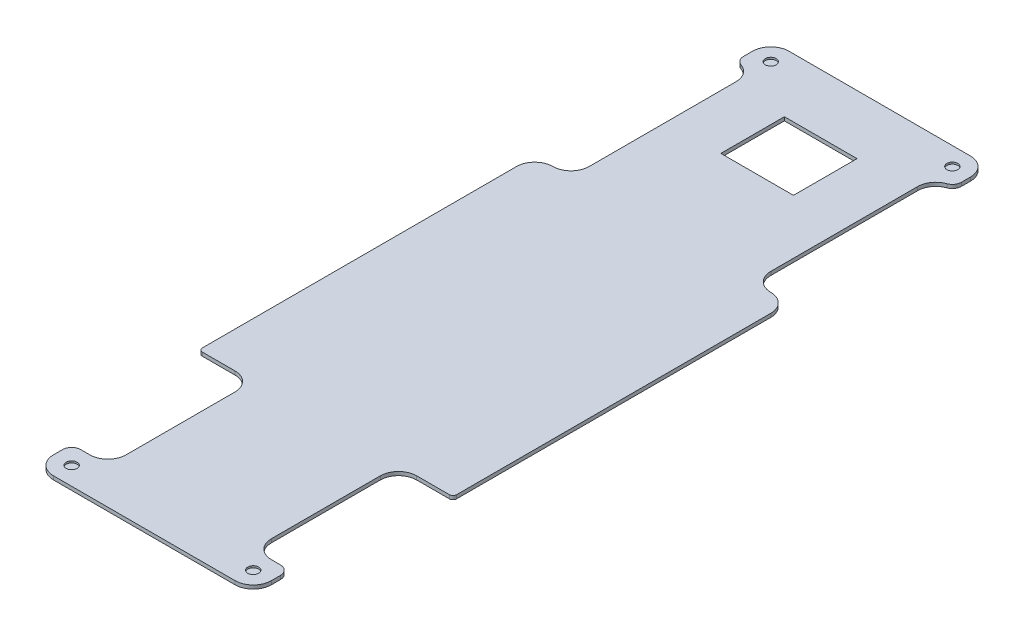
ISO-10303-21;
HEADER;
FILE_DESCRIPTION(('STEP AP214'),'2;1');
FILE_NAME('part.step','',(''),(''),'','','');
FILE_SCHEMA(('AUTOMOTIVE_DESIGN { 1 0 10303 214 1 1 1 1 }'));
ENDSEC;
DATA;
#1=APPLICATION_CONTEXT('core data for automotive mechanical design processes');
#2=APPLICATION_PROTOCOL_DEFINITION('international standard','automotive_design',2000,#1);
#3=PRODUCT_CONTEXT('',#1,'mechanical');
#4=PRODUCT('Part','Part','',(#3));
#5=PRODUCT_RELATED_PRODUCT_CATEGORY('part','',(#4));
#6=PRODUCT_DEFINITION_FORMATION('','',#4);
#7=PRODUCT_DEFINITION_CONTEXT('part definition',#1,'design');
#8=PRODUCT_DEFINITION('design','',#6,#7);
#9=PRODUCT_DEFINITION_SHAPE('','',#8);
#10=(LENGTH_UNIT() NAMED_UNIT(*) SI_UNIT(.MILLI.,.METRE.));
#11=(NAMED_UNIT(*) PLANE_ANGLE_UNIT() SI_UNIT($,.RADIAN.));
#12=(NAMED_UNIT(*) SI_UNIT($,.STERADIAN.) SOLID_ANGLE_UNIT());
#13=UNCERTAINTY_MEASURE_WITH_UNIT(LENGTH_MEASURE(1.E-05),#10,'distance_accuracy_value','');
#14=(GEOMETRIC_REPRESENTATION_CONTEXT(3) GLOBAL_UNCERTAINTY_ASSIGNED_CONTEXT((#13)) GLOBAL_UNIT_ASSIGNED_CONTEXT((#10,
#11,#12)) REPRESENTATION_CONTEXT('',''));
#15=CARTESIAN_POINT('',(0.,0.,0.));
#16=DIRECTION('',(0.,0.,1.));
#17=DIRECTION('',(1.,0.,0.));
#18=AXIS2_PLACEMENT_3D('',#15,#16,#17);
#19=CARTESIAN_POINT('',(-70.,-20.,-45.));
#20=DIRECTION('',(0.,0.,1.));
#21=DIRECTION('',(1.,0.,0.));
#22=AXIS2_PLACEMENT_3D('',#19,#20,#21);
#23=PLANE('',#22);
#24=DIRECTION('',(1.,0.,0.));
#25=VECTOR('',#24,1.);
#26=CARTESIAN_POINT('',(-70.,-18.,-45.));
#27=LINE('',#26,#25);
#28=CARTESIAN_POINT('',(-68.,-18.,-45.));
#29=VERTEX_POINT('',#28);
#30=CARTESIAN_POINT('',(-50.,-18.,-45.));
#31=VERTEX_POINT('',#30);
#32=EDGE_CURVE('E468',#29,#31,#27,.T.);
#33=ORIENTED_EDGE('',*,*,#32,.F.);
#34=DIRECTION('',(0.,1.,0.));
#35=VECTOR('',#34,1.);
#36=CARTESIAN_POINT('',(-68.,-20.,-45.));
#37=LINE('',#36,#35);
#38=CARTESIAN_POINT('',(-68.,-20.,-45.));
#39=VERTEX_POINT('',#38);
#40=EDGE_CURVE('E334',#39,#29,#37,.T.);
#41=ORIENTED_EDGE('',*,*,#40,.F.);
#42=DIRECTION('',(1.,0.,0.));
#43=VECTOR('',#42,1.);
#44=CARTESIAN_POINT('',(-70.,-20.,-45.));
#45=LINE('',#44,#43);
#46=CARTESIAN_POINT('',(-50.,-20.,-45.));
#47=VERTEX_POINT('',#46);
#48=EDGE_CURVE('E467',#39,#47,#45,.T.);
#49=ORIENTED_EDGE('',*,*,#48,.T.);
#50=DIRECTION('',(0.,1.,0.));
#51=VECTOR('',#50,1.);
#52=CARTESIAN_POINT('',(-50.,-18.,-45.));
#53=LINE('',#52,#51);
#54=EDGE_CURVE('E547',#47,#31,#53,.T.);
#55=ORIENTED_EDGE('',*,*,#54,.T.);
#56=EDGE_LOOP('',(#33,#41,#49,#55));
#57=FACE_BOUND('',#56,.T.);
#58=ADVANCED_FACE('F30',(#57),#23,.T.);
#59=CARTESIAN_POINT('',(70.,-448.514877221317,-350.));
#60=DIRECTION('',(1.,0.,0.));
#61=DIRECTION('',(0.,0.,-1.));
#62=AXIS2_PLACEMENT_3D('',#59,#60,#61);
#63=PLANE('',#62);
#64=DIRECTION('',(0.,0.,-1.));
#65=VECTOR('',#64,1.);
#66=CARTESIAN_POINT('',(70.,-18.,-350.));
#67=LINE('',#66,#65);
#68=CARTESIAN_POINT('',(70.,-18.,-47.));
#69=VERTEX_POINT('',#68);
#70=CARTESIAN_POINT('',(70.,-18.,-220.));
#71=VERTEX_POINT('',#70);
#72=EDGE_CURVE('E498',#69,#71,#67,.T.);
#73=ORIENTED_EDGE('',*,*,#72,.F.);
#74=DIRECTION('',(0.,1.,0.));
#75=VECTOR('',#74,1.);
#76=CARTESIAN_POINT('',(70.,-20.,-47.));
#77=LINE('',#76,#75);
#78=CARTESIAN_POINT('',(70.,-20.,-47.));
#79=VERTEX_POINT('',#78);
#80=EDGE_CURVE('E344',#79,#69,#77,.T.);
#81=ORIENTED_EDGE('',*,*,#80,.F.);
#82=DIRECTION('',(0.,0.,1.));
#83=VECTOR('',#82,1.);
#84=CARTESIAN_POINT('',(70.,-20.,-350.));
#85=LINE('',#84,#83);
#86=CARTESIAN_POINT('',(70.,-20.,-220.));
#87=VERTEX_POINT('',#86);
#88=EDGE_CURVE('E485',#87,#79,#85,.T.);
#89=ORIENTED_EDGE('',*,*,#88,.F.);
#90=DIRECTION('',(0.,1.,0.));
#91=VECTOR('',#90,1.);
#92=CARTESIAN_POINT('',(70.,-18.,-220.));
#93=LINE('',#92,#91);
#94=EDGE_CURVE('E518',#87,#71,#93,.T.);
#95=ORIENTED_EDGE('',*,*,#94,.T.);
#96=EDGE_LOOP('',(#73,#81,#89,#95));
#97=FACE_BOUND('',#96,.T.);
#98=ADVANCED_FACE('F697',(#97),#63,.T.);
#99=CARTESIAN_POINT('',(70.,-35.,-45.));
#100=DIRECTION('',(0.,0.,-1.));
#101=DIRECTION('',(-1.,0.,0.));
#102=AXIS2_PLACEMENT_3D('',#99,#100,#101);
#103=PLANE('',#102);
#104=DIRECTION('',(0.,1.,0.));
#105=VECTOR('',#104,1.);
#106=CARTESIAN_POINT('',(68.,-20.,-45.));
#107=LINE('',#106,#105);
#108=CARTESIAN_POINT('',(68.,-20.,-45.));
#109=VERTEX_POINT('',#108);
#110=CARTESIAN_POINT('',(68.,-18.,-45.));
#111=VERTEX_POINT('',#110);
#112=EDGE_CURVE('E342',#109,#111,#107,.T.);
#113=ORIENTED_EDGE('',*,*,#112,.T.);
#114=DIRECTION('',(-1.,0.,0.));
#115=VECTOR('',#114,1.);
#116=CARTESIAN_POINT('',(70.,-18.,-45.));
#117=LINE('',#116,#115);
#118=CARTESIAN_POINT('',(50.,-18.,-45.));
#119=VERTEX_POINT('',#118);
#120=EDGE_CURVE('E479',#111,#119,#117,.T.);
#121=ORIENTED_EDGE('',*,*,#120,.T.);
#122=DIRECTION('',(0.,1.,0.));
#123=VECTOR('',#122,1.);
#124=CARTESIAN_POINT('',(50.,-20.,-45.));
#125=LINE('',#124,#123);
#126=CARTESIAN_POINT('',(50.,-20.,-45.));
#127=VERTEX_POINT('',#126);
#128=EDGE_CURVE('E556',#119,#127,#125,.F.);
#129=ORIENTED_EDGE('',*,*,#128,.T.);
#130=DIRECTION('',(-1.,0.,0.));
#131=VECTOR('',#130,1.);
#132=CARTESIAN_POINT('',(0.,-20.,-45.));
#133=LINE('',#132,#131);
#134=EDGE_CURVE('E503',#109,#127,#133,.T.);
#135=ORIENTED_EDGE('',*,*,#134,.F.);
#136=EDGE_LOOP('',(#113,#121,#129,#135));
#137=FACE_BOUND('',#136,.T.);
#138=ADVANCED_FACE('F689',(#137),#103,.F.);
#139=CARTESIAN_POINT('',(-70.,-448.514877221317,-350.));
#140=DIRECTION('',(-1.,0.,0.));
#141=DIRECTION('',(0.,0.,1.));
#142=AXIS2_PLACEMENT_3D('',#139,#140,#141);
#143=PLANE('',#142);
#144=DIRECTION('',(0.,1.,0.));
#145=VECTOR('',#144,1.);
#146=CARTESIAN_POINT('',(-70.,-20.,-47.));
#147=LINE('',#146,#145);
#148=CARTESIAN_POINT('',(-70.,-20.,-47.));
#149=VERTEX_POINT('',#148);
#150=CARTESIAN_POINT('',(-70.,-18.,-47.));
#151=VERTEX_POINT('',#150);
#152=EDGE_CURVE('E332',#149,#151,#147,.T.);
#153=ORIENTED_EDGE('',*,*,#152,.T.);
#154=DIRECTION('',(0.,0.,1.));
#155=VECTOR('',#154,1.);
#156=CARTESIAN_POINT('',(-70.,-18.,-350.));
#157=LINE('',#156,#155);
#158=CARTESIAN_POINT('',(-70.,-18.,-220.));
#159=VERTEX_POINT('',#158);
#160=EDGE_CURVE('E484',#159,#151,#157,.T.);
#161=ORIENTED_EDGE('',*,*,#160,.F.);
#162=DIRECTION('',(0.,1.,0.));
#163=VECTOR('',#162,1.);
#164=CARTESIAN_POINT('',(-70.,-448.514877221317,-220.));
#165=LINE('',#164,#163);
#166=CARTESIAN_POINT('',(-70.,-20.,-220.));
#167=VERTEX_POINT('',#166);
#168=EDGE_CURVE('E537',#159,#167,#165,.F.);
#169=ORIENTED_EDGE('',*,*,#168,.T.);
#170=DIRECTION('',(0.,0.,-1.));
#171=VECTOR('',#170,1.);
#172=CARTESIAN_POINT('',(-70.,-20.,-350.));
#173=LINE('',#172,#171);
#174=EDGE_CURVE('E491',#149,#167,#173,.T.);
#175=ORIENTED_EDGE('',*,*,#174,.F.);
#176=EDGE_LOOP('',(#153,#161,#169,#175));
#177=FACE_BOUND('',#176,.T.);
#178=ADVANCED_FACE('F610',(#177),#143,.T.);
#179=CARTESIAN_POINT('',(-70.,-18.,55.));
#180=DIRECTION('',(0.,1.,0.));
#181=DIRECTION('',(0.,0.,1.));
#182=AXIS2_PLACEMENT_3D('',#179,#180,#181);
#183=PLANE('',#182);
#184=CARTESIAN_POINT('',(-50.,-18.,-340.));
#185=DIRECTION('',(0.,1.,0.));
#186=DIRECTION('',(0.,0.,1.));
#187=AXIS2_PLACEMENT_3D('',#184,#185,#186);
#188=CIRCLE('',#187,3.);
#189=CARTESIAN_POINT('',(-50.,-18.,-337.));
#190=VERTEX_POINT('',#189);
#191=EDGE_CURVE('E1100',#190,#190,#188,.T.);
#192=ORIENTED_EDGE('',*,*,#191,.F.);
#193=EDGE_LOOP('',(#192));
#194=FACE_BOUND('',#193,.T.);
#195=CARTESIAN_POINT('',(50.,-18.,-340.));
#196=DIRECTION('',(0.,1.,0.));
#197=DIRECTION('',(0.,0.,1.));
#198=AXIS2_PLACEMENT_3D('',#195,#196,#197);
#199=CIRCLE('',#198,3.);
#200=CARTESIAN_POINT('',(50.,-18.,-337.));
#201=VERTEX_POINT('',#200);
#202=EDGE_CURVE('E1099',#201,#201,#199,.T.);
#203=ORIENTED_EDGE('',*,*,#202,.F.);
#204=EDGE_LOOP('',(#203));
#205=FACE_BOUND('',#204,.T.);
#206=CARTESIAN_POINT('',(-50.,-18.,45.));
#207=DIRECTION('',(0.,1.,0.));
#208=DIRECTION('',(0.,0.,1.));
#209=AXIS2_PLACEMENT_3D('',#206,#207,#208);
#210=CIRCLE('',#209,3.);
#211=CARTESIAN_POINT('',(-50.,-18.,48.));
#212=VERTEX_POINT('',#211);
#213=EDGE_CURVE('E1109',#212,#212,#210,.T.);
#214=ORIENTED_EDGE('',*,*,#213,.F.);
#215=EDGE_LOOP('',(#214));
#216=FACE_BOUND('',#215,.T.);
#217=CARTESIAN_POINT('',(50.,-18.,45.));
#218=DIRECTION('',(0.,1.,0.));
#219=DIRECTION('',(0.,0.,1.));
#220=AXIS2_PLACEMENT_3D('',#217,#218,#219);
#221=CIRCLE('',#220,3.);
#222=CARTESIAN_POINT('',(50.,-18.,48.));
#223=VERTEX_POINT('',#222);
#224=EDGE_CURVE('E312',#223,#223,#221,.T.);
#225=ORIENTED_EDGE('',*,*,#224,.F.);
#226=EDGE_LOOP('',(#225));
#227=FACE_BOUND('',#226,.T.);
#228=DIRECTION('',(0.,0.,-1.));
#229=VECTOR('',#228,1.);
#230=CARTESIAN_POINT('',(-20.,-18.,-282.5));
#231=LINE('',#230,#229);
#232=CARTESIAN_POINT('',(-20.,-18.,-282.5));
#233=VERTEX_POINT('',#232);
#234=CARTESIAN_POINT('',(-20.,-18.,-317.5));
#235=VERTEX_POINT('',#234);
#236=EDGE_CURVE('E290',#233,#235,#231,.T.);
#237=ORIENTED_EDGE('',*,*,#236,.T.);
#238=DIRECTION('',(1.,0.,0.));
#239=VECTOR('',#238,1.);
#240=CARTESIAN_POINT('',(-20.,-18.,-317.5));
#241=LINE('',#240,#239);
#242=CARTESIAN_POINT('',(20.,-18.,-317.5));
#243=VERTEX_POINT('',#242);
#244=EDGE_CURVE('E299',#235,#243,#241,.T.);
#245=ORIENTED_EDGE('',*,*,#244,.T.);
#246=DIRECTION('',(0.,0.,1.));
#247=VECTOR('',#246,1.);
#248=CARTESIAN_POINT('',(20.,-18.,-282.5));
#249=LINE('',#248,#247);
#250=CARTESIAN_POINT('',(20.,-18.,-282.5));
#251=VERTEX_POINT('',#250);
#252=EDGE_CURVE('E47',#243,#251,#249,.T.);
#253=ORIENTED_EDGE('',*,*,#252,.T.);
#254=DIRECTION('',(-1.,0.,0.));
#255=VECTOR('',#254,1.);
#256=CARTESIAN_POINT('',(-20.,-18.,-282.5));
#257=LINE('',#256,#255);
#258=EDGE_CURVE('E296',#251,#233,#257,.T.);
#259=ORIENTED_EDGE('',*,*,#258,.T.);
#260=EDGE_LOOP('',(#237,#245,#253,#259));
#261=FACE_BOUND('',#260,.T.);
#262=CARTESIAN_POINT('',(-68.,-18.,-47.));
#263=DIRECTION('',(0.,-1.,0.));
#264=DIRECTION('',(0.,0.,1.));
#265=AXIS2_PLACEMENT_3D('',#262,#263,#264);
#266=CIRCLE('',#265,2.);
#267=EDGE_CURVE('E325',#29,#151,#266,.T.);
#268=ORIENTED_EDGE('',*,*,#267,.F.);
#269=ORIENTED_EDGE('',*,*,#32,.T.);
#270=CARTESIAN_POINT('',(-50.,-18.,-35.));
#271=DIRECTION('',(0.,1.,0.));
#272=DIRECTION('',(0.,0.,1.));
#273=AXIS2_PLACEMENT_3D('',#270,#271,#272);
#274=CIRCLE('',#273,10.);
#275=CARTESIAN_POINT('',(-40.,-18.,-35.));
#276=VERTEX_POINT('',#275);
#277=EDGE_CURVE('E581',#31,#276,#274,.F.);
#278=ORIENTED_EDGE('',*,*,#277,.T.);
#279=DIRECTION('',(0.,0.,1.));
#280=VECTOR('',#279,1.);
#281=CARTESIAN_POINT('',(-40.,-18.,55.));
#282=LINE('',#281,#280);
#283=CARTESIAN_POINT('',(-40.,-18.,25.));
#284=VERTEX_POINT('',#283);
#285=EDGE_CURVE('E463',#276,#284,#282,.T.);
#286=ORIENTED_EDGE('',*,*,#285,.T.);
#287=CARTESIAN_POINT('',(-50.,-18.,25.));
#288=DIRECTION('',(0.,1.,0.));
#289=DIRECTION('',(0.,0.,1.));
#290=AXIS2_PLACEMENT_3D('',#287,#288,#289);
#291=CIRCLE('',#290,10.);
#292=CARTESIAN_POINT('',(-50.,-18.,35.));
#293=VERTEX_POINT('',#292);
#294=EDGE_CURVE('E579',#284,#293,#291,.F.);
#295=ORIENTED_EDGE('',*,*,#294,.T.);
#296=DIRECTION('',(1.,0.,0.));
#297=VECTOR('',#296,1.);
#298=CARTESIAN_POINT('',(-55.,-18.,35.));
#299=LINE('',#298,#297);
#300=CARTESIAN_POINT('',(-55.,-18.,35.));
#301=VERTEX_POINT('',#300);
#302=EDGE_CURVE('E435',#301,#293,#299,.T.);
#303=ORIENTED_EDGE('',*,*,#302,.F.);
#304=CARTESIAN_POINT('',(-55.,-18.,40.));
#305=DIRECTION('',(0.,1.,0.));
#306=DIRECTION('',(0.,0.,1.));
#307=AXIS2_PLACEMENT_3D('',#304,#305,#306);
#308=CIRCLE('',#307,5.);
#309=CARTESIAN_POINT('',(-60.,-18.,40.));
#310=VERTEX_POINT('',#309);
#311=EDGE_CURVE('E439',#310,#301,#308,.F.);
#312=ORIENTED_EDGE('',*,*,#311,.F.);
#313=DIRECTION('',(0.,0.,-1.));
#314=VECTOR('',#313,1.);
#315=CARTESIAN_POINT('',(-60.,-18.,44.9999999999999));
#316=LINE('',#315,#314);
#317=CARTESIAN_POINT('',(-60.,-18.,44.9999999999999));
#318=VERTEX_POINT('',#317);
#319=EDGE_CURVE('E395',#318,#310,#316,.T.);
#320=ORIENTED_EDGE('',*,*,#319,.F.);
#321=CARTESIAN_POINT('',(-50.,-18.,45.));
#322=DIRECTION('',(0.,1.,0.));
#323=DIRECTION('',(0.,0.,1.));
#324=AXIS2_PLACEMENT_3D('',#321,#322,#323);
#325=CIRCLE('',#324,10.);
#326=CARTESIAN_POINT('',(-49.9999999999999,-18.,55.));
#327=VERTEX_POINT('',#326);
#328=EDGE_CURVE('E417',#327,#318,#325,.F.);
#329=ORIENTED_EDGE('',*,*,#328,.F.);
#330=DIRECTION('',(1.,0.,0.));
#331=VECTOR('',#330,1.);
#332=CARTESIAN_POINT('',(-70.,-18.,55.));
#333=LINE('',#332,#331);
#334=CARTESIAN_POINT('',(50.,-18.,55.));
#335=VERTEX_POINT('',#334);
#336=EDGE_CURVE('E496',#327,#335,#333,.T.);
#337=ORIENTED_EDGE('',*,*,#336,.T.);
#338=CARTESIAN_POINT('',(50.,-18.,45.));
#339=DIRECTION('',(0.,1.,0.));
#340=DIRECTION('',(0.,0.,1.));
#341=AXIS2_PLACEMENT_3D('',#338,#339,#340);
#342=CIRCLE('',#341,10.);
#343=CARTESIAN_POINT('',(60.,-18.,44.9999999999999));
#344=VERTEX_POINT('',#343);
#345=EDGE_CURVE('E422',#344,#335,#342,.F.);
#346=ORIENTED_EDGE('',*,*,#345,.F.);
#347=DIRECTION('',(0.,0.,1.));
#348=VECTOR('',#347,1.);
#349=CARTESIAN_POINT('',(60.,-18.,44.9999999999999));
#350=LINE('',#349,#348);
#351=CARTESIAN_POINT('',(60.,-18.,40.));
#352=VERTEX_POINT('',#351);
#353=EDGE_CURVE('E427',#352,#344,#350,.T.);
#354=ORIENTED_EDGE('',*,*,#353,.F.);
#355=CARTESIAN_POINT('',(55.,-18.,40.));
#356=DIRECTION('',(0.,1.,0.));
#357=DIRECTION('',(0.,0.,1.));
#358=AXIS2_PLACEMENT_3D('',#355,#356,#357);
#359=CIRCLE('',#358,5.);
#360=CARTESIAN_POINT('',(55.,-18.,35.));
#361=VERTEX_POINT('',#360);
#362=EDGE_CURVE('E431',#361,#352,#359,.F.);
#363=ORIENTED_EDGE('',*,*,#362,.F.);
#364=CARTESIAN_POINT('',(50.,-18.,35.));
#365=VERTEX_POINT('',#364);
#366=EDGE_CURVE('E438',#365,#361,#299,.T.);
#367=ORIENTED_EDGE('',*,*,#366,.F.);
#368=CARTESIAN_POINT('',(50.,-18.,25.));
#369=DIRECTION('',(0.,1.,0.));
#370=DIRECTION('',(0.,0.,1.));
#371=AXIS2_PLACEMENT_3D('',#368,#369,#370);
#372=CIRCLE('',#371,10.);
#373=CARTESIAN_POINT('',(40.,-18.,25.));
#374=VERTEX_POINT('',#373);
#375=EDGE_CURVE('E11',#365,#374,#372,.F.);
#376=ORIENTED_EDGE('',*,*,#375,.T.);
#377=DIRECTION('',(0.,0.,1.));
#378=VECTOR('',#377,1.);
#379=CARTESIAN_POINT('',(40.,-18.,55.));
#380=LINE('',#379,#378);
#381=CARTESIAN_POINT('',(40.,-18.,-35.));
#382=VERTEX_POINT('',#381);
#383=EDGE_CURVE('E481',#382,#374,#380,.T.);
#384=ORIENTED_EDGE('',*,*,#383,.F.);
#385=CARTESIAN_POINT('',(50.,-18.,-35.));
#386=DIRECTION('',(0.,1.,0.));
#387=DIRECTION('',(0.,0.,1.));
#388=AXIS2_PLACEMENT_3D('',#385,#386,#387);
#389=CIRCLE('',#388,10.);
#390=EDGE_CURVE('E586',#382,#119,#389,.F.);
#391=ORIENTED_EDGE('',*,*,#390,.T.);
#392=ORIENTED_EDGE('',*,*,#120,.F.);
#393=CARTESIAN_POINT('',(68.,-18.,-47.));
#394=DIRECTION('',(0.,-1.,0.));
#395=DIRECTION('',(0.,0.,1.));
#396=AXIS2_PLACEMENT_3D('',#393,#394,#395);
#397=CIRCLE('',#396,2.);
#398=EDGE_CURVE('E336',#69,#111,#397,.T.);
#399=ORIENTED_EDGE('',*,*,#398,.F.);
#400=ORIENTED_EDGE('',*,*,#72,.T.);
#401=CARTESIAN_POINT('',(60.,-18.,-220.));
#402=DIRECTION('',(0.,1.,0.));
#403=DIRECTION('',(0.,0.,1.));
#404=AXIS2_PLACEMENT_3D('',#401,#402,#403);
#405=CIRCLE('',#404,10.);
#406=CARTESIAN_POINT('',(60.,-18.,-230.));
#407=VERTEX_POINT('',#406);
#408=EDGE_CURVE('E523',#71,#407,#405,.T.);
#409=ORIENTED_EDGE('',*,*,#408,.T.);
#410=CARTESIAN_POINT('',(60.,-18.,-240.));
#411=DIRECTION('',(0.,1.,0.));
#412=DIRECTION('',(0.,0.,1.));
#413=AXIS2_PLACEMENT_3D('',#410,#411,#412);
#414=CIRCLE('',#413,10.);
#415=CARTESIAN_POINT('',(50.,-18.,-240.));
#416=VERTEX_POINT('',#415);
#417=EDGE_CURVE('E565',#407,#416,#414,.F.);
#418=ORIENTED_EDGE('',*,*,#417,.T.);
#419=DIRECTION('',(0.,0.,1.));
#420=VECTOR('',#419,1.);
#421=CARTESIAN_POINT('',(50.,-18.,-350.));
#422=LINE('',#421,#420);
#423=CARTESIAN_POINT('',(50.,-18.,-320.857864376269));
#424=VERTEX_POINT('',#423);
#425=EDGE_CURVE('E470',#424,#416,#422,.T.);
#426=ORIENTED_EDGE('',*,*,#425,.F.);
#427=CARTESIAN_POINT('',(60.,-18.,-320.857864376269));
#428=DIRECTION('',(0.,1.,0.));
#429=DIRECTION('',(0.,0.,1.));
#430=AXIS2_PLACEMENT_3D('',#427,#428,#429);
#431=CIRCLE('',#430,10.);
#432=CARTESIAN_POINT('',(56.6666666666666,-18.,-330.28595479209));
#433=VERTEX_POINT('',#432);
#434=EDGE_CURVE('E561',#424,#433,#431,.F.);
#435=ORIENTED_EDGE('',*,*,#434,.T.);
#436=CARTESIAN_POINT('',(54.9999999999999,-18.,-335.));
#437=DIRECTION('',(0.,1.,0.));
#438=DIRECTION('',(0.,0.,1.));
#439=AXIS2_PLACEMENT_3D('',#436,#437,#438);
#440=CIRCLE('',#439,5.);
#441=CARTESIAN_POINT('',(59.9999999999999,-18.,-335.));
#442=VERTEX_POINT('',#441);
#443=EDGE_CURVE('E367',#442,#433,#440,.F.);
#444=ORIENTED_EDGE('',*,*,#443,.F.);
#445=DIRECTION('',(0.,0.,1.));
#446=VECTOR('',#445,1.);
#447=CARTESIAN_POINT('',(59.9999999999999,-18.,-340.));
#448=LINE('',#447,#446);
#449=CARTESIAN_POINT('',(59.9999999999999,-18.,-340.));
#450=VERTEX_POINT('',#449);
#451=EDGE_CURVE('E372',#450,#442,#448,.T.);
#452=ORIENTED_EDGE('',*,*,#451,.F.);
#453=CARTESIAN_POINT('',(50.,-18.,-340.));
#454=DIRECTION('',(0.,1.,0.));
#455=DIRECTION('',(0.,0.,1.));
#456=AXIS2_PLACEMENT_3D('',#453,#454,#455);
#457=CIRCLE('',#456,9.99999999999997);
#458=CARTESIAN_POINT('',(49.9999999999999,-18.,-350.));
#459=VERTEX_POINT('',#458);
#460=EDGE_CURVE('E376',#459,#450,#457,.F.);
#461=ORIENTED_EDGE('',*,*,#460,.F.);
#462=DIRECTION('',(-1.,0.,0.));
#463=VECTOR('',#462,1.);
#464=CARTESIAN_POINT('',(-70.,-18.,-350.));
#465=LINE('',#464,#463);
#466=CARTESIAN_POINT('',(-50.,-18.,-350.));
#467=VERTEX_POINT('',#466);
#468=EDGE_CURVE('E489',#459,#467,#465,.T.);
#469=ORIENTED_EDGE('',*,*,#468,.T.);
#470=CARTESIAN_POINT('',(-50.,-18.,-340.));
#471=DIRECTION('',(0.,1.,0.));
#472=DIRECTION('',(0.,0.,1.));
#473=AXIS2_PLACEMENT_3D('',#470,#471,#472);
#474=CIRCLE('',#473,9.99999999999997);
#475=CARTESIAN_POINT('',(-60.,-18.,-340.));
#476=VERTEX_POINT('',#475);
#477=EDGE_CURVE('E379',#476,#467,#474,.F.);
#478=ORIENTED_EDGE('',*,*,#477,.F.);
#479=DIRECTION('',(0.,0.,-1.));
#480=VECTOR('',#479,1.);
#481=CARTESIAN_POINT('',(-60.,-18.,-340.));
#482=LINE('',#481,#480);
#483=CARTESIAN_POINT('',(-60.,-18.,-335.));
#484=VERTEX_POINT('',#483);
#485=EDGE_CURVE('E382',#484,#476,#482,.T.);
#486=ORIENTED_EDGE('',*,*,#485,.F.);
#487=CARTESIAN_POINT('',(-55.,-18.,-335.));
#488=DIRECTION('',(0.,1.,0.));
#489=DIRECTION('',(0.,0.,1.));
#490=AXIS2_PLACEMENT_3D('',#487,#488,#489);
#491=CIRCLE('',#490,5.00000000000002);
#492=CARTESIAN_POINT('',(-56.6666666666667,-18.,-330.28595479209));
#493=VERTEX_POINT('',#492);
#494=EDGE_CURVE('E351',#493,#484,#491,.F.);
#495=ORIENTED_EDGE('',*,*,#494,.F.);
#496=CARTESIAN_POINT('',(-60.,-18.,-320.857864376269));
#497=DIRECTION('',(0.,1.,0.));
#498=DIRECTION('',(0.,0.,1.));
#499=AXIS2_PLACEMENT_3D('',#496,#497,#498);
#500=CIRCLE('',#499,10.);
#501=CARTESIAN_POINT('',(-50.,-18.,-320.857864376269));
#502=VERTEX_POINT('',#501);
#503=EDGE_CURVE('E569',#493,#502,#500,.F.);
#504=ORIENTED_EDGE('',*,*,#503,.T.);
#505=DIRECTION('',(0.,0.,1.));
#506=VECTOR('',#505,1.);
#507=CARTESIAN_POINT('',(-50.,-18.,-350.));
#508=LINE('',#507,#506);
#509=CARTESIAN_POINT('',(-50.,-18.,-240.));
#510=VERTEX_POINT('',#509);
#511=EDGE_CURVE('E454',#502,#510,#508,.T.);
#512=ORIENTED_EDGE('',*,*,#511,.T.);
#513=CARTESIAN_POINT('',(-60.,-18.,-240.));
#514=DIRECTION('',(0.,1.,0.));
#515=DIRECTION('',(0.,0.,1.));
#516=AXIS2_PLACEMENT_3D('',#513,#514,#515);
#517=CIRCLE('',#516,10.);
#518=CARTESIAN_POINT('',(-60.,-18.,-230.));
#519=VERTEX_POINT('',#518);
#520=EDGE_CURVE('E573',#510,#519,#517,.F.);
#521=ORIENTED_EDGE('',*,*,#520,.T.);
#522=CARTESIAN_POINT('',(-60.,-18.,-220.));
#523=DIRECTION('',(0.,1.,0.));
#524=DIRECTION('',(0.,0.,1.));
#525=AXIS2_PLACEMENT_3D('',#522,#523,#524);
#526=CIRCLE('',#525,10.);
#527=EDGE_CURVE('E521',#519,#159,#526,.T.);
#528=ORIENTED_EDGE('',*,*,#527,.T.);
#529=ORIENTED_EDGE('',*,*,#160,.T.);
#530=EDGE_LOOP('',(#268,#269,#278,#286,#295,#303,#312,#320,#329,#337,#346,#354,#363,#367,#376,
#384,#391,#392,#399,#400,#409,#418,#426,#435,#444,#452,#461,#469,#478,#486,#495,#504,#512,#521,
#528,#529));
#531=FACE_BOUND('',#530,.T.);
#532=ADVANCED_FACE('F303',(#194,#205,#216,#227,#261,#531),#183,.T.);
#533=CARTESIAN_POINT('',(0.,-20.,0.));
#534=DIRECTION('',(0.,1.,0.));
#535=DIRECTION('',(0.,0.,1.));
#536=AXIS2_PLACEMENT_3D('',#533,#534,#535);
#537=PLANE('',#536);
#538=DIRECTION('',(1.,0.,0.));
#539=VECTOR('',#538,1.);
#540=CARTESIAN_POINT('',(-20.,-20.,-317.5));
#541=LINE('',#540,#539);
#542=CARTESIAN_POINT('',(-20.,-20.,-317.5));
#543=VERTEX_POINT('',#542);
#544=CARTESIAN_POINT('',(20.,-20.,-317.5));
#545=VERTEX_POINT('',#544);
#546=EDGE_CURVE('E318',#543,#545,#541,.T.);
#547=ORIENTED_EDGE('',*,*,#546,.F.);
#548=DIRECTION('',(0.,0.,-1.));
#549=VECTOR('',#548,1.);
#550=CARTESIAN_POINT('',(-20.,-20.,-282.5));
#551=LINE('',#550,#549);
#552=CARTESIAN_POINT('',(-20.,-20.,-282.5));
#553=VERTEX_POINT('',#552);
#554=EDGE_CURVE('E55',#553,#543,#551,.T.);
#555=ORIENTED_EDGE('',*,*,#554,.F.);
#556=DIRECTION('',(-1.,0.,0.));
#557=VECTOR('',#556,1.);
#558=CARTESIAN_POINT('',(-20.,-20.,-282.5));
#559=LINE('',#558,#557);
#560=CARTESIAN_POINT('',(20.,-20.,-282.5));
#561=VERTEX_POINT('',#560);
#562=EDGE_CURVE('E306',#561,#553,#559,.T.);
#563=ORIENTED_EDGE('',*,*,#562,.F.);
#564=DIRECTION('',(0.,0.,1.));
#565=VECTOR('',#564,1.);
#566=CARTESIAN_POINT('',(20.,-20.,-282.5));
#567=LINE('',#566,#565);
#568=EDGE_CURVE('E309',#545,#561,#567,.T.);
#569=ORIENTED_EDGE('',*,*,#568,.F.);
#570=EDGE_LOOP('',(#547,#555,#563,#569));
#571=FACE_BOUND('',#570,.T.);
#572=ORIENTED_EDGE('',*,*,#48,.F.);
#573=CARTESIAN_POINT('',(-68.,-20.,-47.));
#574=DIRECTION('',(0.,-1.,0.));
#575=DIRECTION('',(0.,0.,1.));
#576=AXIS2_PLACEMENT_3D('',#573,#574,#575);
#577=CIRCLE('',#576,2.);
#578=EDGE_CURVE('E329',#39,#149,#577,.T.);
#579=ORIENTED_EDGE('',*,*,#578,.T.);
#580=ORIENTED_EDGE('',*,*,#174,.T.);
#581=CARTESIAN_POINT('',(-60.,-20.,-220.));
#582=DIRECTION('',(0.,1.,0.));
#583=DIRECTION('',(0.,0.,1.));
#584=AXIS2_PLACEMENT_3D('',#581,#582,#583);
#585=CIRCLE('',#584,10.);
#586=CARTESIAN_POINT('',(-60.,-20.,-230.));
#587=VERTEX_POINT('',#586);
#588=EDGE_CURVE('E525',#167,#587,#585,.F.);
#589=ORIENTED_EDGE('',*,*,#588,.T.);
#590=CARTESIAN_POINT('',(-60.,-20.,-240.));
#591=DIRECTION('',(0.,1.,0.));
#592=DIRECTION('',(0.,0.,1.));
#593=AXIS2_PLACEMENT_3D('',#590,#591,#592);
#594=CIRCLE('',#593,10.);
#595=CARTESIAN_POINT('',(-50.,-20.,-240.));
#596=VERTEX_POINT('',#595);
#597=EDGE_CURVE('E575',#587,#596,#594,.T.);
#598=ORIENTED_EDGE('',*,*,#597,.T.);
#599=DIRECTION('',(0.,0.,1.));
#600=VECTOR('',#599,1.);
#601=CARTESIAN_POINT('',(-50.,-20.,-350.));
#602=LINE('',#601,#600);
#603=CARTESIAN_POINT('',(-50.,-20.,-320.857864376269));
#604=VERTEX_POINT('',#603);
#605=EDGE_CURVE('E455',#604,#596,#602,.T.);
#606=ORIENTED_EDGE('',*,*,#605,.F.);
#607=CARTESIAN_POINT('',(-60.,-20.,-320.857864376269));
#608=DIRECTION('',(0.,1.,0.));
#609=DIRECTION('',(0.,0.,1.));
#610=AXIS2_PLACEMENT_3D('',#607,#608,#609);
#611=CIRCLE('',#610,10.);
#612=CARTESIAN_POINT('',(-56.6666666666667,-20.,-330.28595479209));
#613=VERTEX_POINT('',#612);
#614=EDGE_CURVE('E571',#604,#613,#611,.T.);
#615=ORIENTED_EDGE('',*,*,#614,.T.);
#616=CARTESIAN_POINT('',(-55.,-20.,-335.));
#617=DIRECTION('',(0.,-1.,0.));
#618=DIRECTION('',(0.,0.,1.));
#619=AXIS2_PLACEMENT_3D('',#616,#617,#618);
#620=CIRCLE('',#619,5.00000000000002);
#621=CARTESIAN_POINT('',(-60.,-20.,-335.));
#622=VERTEX_POINT('',#621);
#623=EDGE_CURVE('E361',#613,#622,#620,.T.);
#624=ORIENTED_EDGE('',*,*,#623,.T.);
#625=DIRECTION('',(0.,0.,-1.));
#626=VECTOR('',#625,1.);
#627=CARTESIAN_POINT('',(-60.,-20.,-340.));
#628=LINE('',#627,#626);
#629=CARTESIAN_POINT('',(-60.,-20.,-340.));
#630=VERTEX_POINT('',#629);
#631=EDGE_CURVE('E358',#622,#630,#628,.T.);
#632=ORIENTED_EDGE('',*,*,#631,.T.);
#633=CARTESIAN_POINT('',(-50.,-20.,-340.));
#634=DIRECTION('',(0.,-1.,0.));
#635=DIRECTION('',(0.,0.,1.));
#636=AXIS2_PLACEMENT_3D('',#633,#634,#635);
#637=CIRCLE('',#636,9.99999999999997);
#638=CARTESIAN_POINT('',(-49.9999999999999,-20.,-350.));
#639=VERTEX_POINT('',#638);
#640=EDGE_CURVE('E355',#630,#639,#637,.T.);
#641=ORIENTED_EDGE('',*,*,#640,.T.);
#642=DIRECTION('',(1.,0.,0.));
#643=VECTOR('',#642,1.);
#644=CARTESIAN_POINT('',(-70.,-20.,-350.));
#645=LINE('',#644,#643);
#646=CARTESIAN_POINT('',(50.,-20.,-350.));
#647=VERTEX_POINT('',#646);
#648=EDGE_CURVE('E488',#639,#647,#645,.T.);
#649=ORIENTED_EDGE('',*,*,#648,.T.);
#650=CARTESIAN_POINT('',(50.,-20.,-340.));
#651=DIRECTION('',(0.,-1.,0.));
#652=DIRECTION('',(0.,0.,-1.));
#653=AXIS2_PLACEMENT_3D('',#650,#651,#652);
#654=CIRCLE('',#653,9.99999999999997);
#655=CARTESIAN_POINT('',(59.9999999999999,-20.,-340.));
#656=VERTEX_POINT('',#655);
#657=EDGE_CURVE('E352',#647,#656,#654,.T.);
#658=ORIENTED_EDGE('',*,*,#657,.T.);
#659=DIRECTION('',(0.,0.,1.));
#660=VECTOR('',#659,1.);
#661=CARTESIAN_POINT('',(59.9999999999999,-20.,-340.));
#662=LINE('',#661,#660);
#663=CARTESIAN_POINT('',(59.9999999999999,-20.,-335.));
#664=VERTEX_POINT('',#663);
#665=EDGE_CURVE('E348',#656,#664,#662,.T.);
#666=ORIENTED_EDGE('',*,*,#665,.T.);
#667=CARTESIAN_POINT('',(54.9999999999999,-20.,-335.));
#668=DIRECTION('',(0.,-1.,0.));
#669=DIRECTION('',(0.,0.,1.));
#670=AXIS2_PLACEMENT_3D('',#667,#668,#669);
#671=CIRCLE('',#670,5.);
#672=CARTESIAN_POINT('',(56.6666666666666,-20.,-330.28595479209));
#673=VERTEX_POINT('',#672);
#674=EDGE_CURVE('E363',#664,#673,#671,.T.);
#675=ORIENTED_EDGE('',*,*,#674,.T.);
#676=CARTESIAN_POINT('',(60.,-20.,-320.857864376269));
#677=DIRECTION('',(0.,1.,0.));
#678=DIRECTION('',(0.,0.,1.));
#679=AXIS2_PLACEMENT_3D('',#676,#677,#678);
#680=CIRCLE('',#679,10.);
#681=CARTESIAN_POINT('',(50.,-20.,-320.857864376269));
#682=VERTEX_POINT('',#681);
#683=EDGE_CURVE('E563',#673,#682,#680,.T.);
#684=ORIENTED_EDGE('',*,*,#683,.T.);
#685=DIRECTION('',(0.,0.,1.));
#686=VECTOR('',#685,1.);
#687=CARTESIAN_POINT('',(50.,-20.,0.));
#688=LINE('',#687,#686);
#689=CARTESIAN_POINT('',(50.,-20.,-240.));
#690=VERTEX_POINT('',#689);
#691=EDGE_CURVE('E508',#682,#690,#688,.T.);
#692=ORIENTED_EDGE('',*,*,#691,.T.);
#693=CARTESIAN_POINT('',(60.,-20.,-240.));
#694=DIRECTION('',(0.,1.,0.));
#695=DIRECTION('',(0.,0.,1.));
#696=AXIS2_PLACEMENT_3D('',#693,#694,#695);
#697=CIRCLE('',#696,10.);
#698=CARTESIAN_POINT('',(60.,-20.,-230.));
#699=VERTEX_POINT('',#698);
#700=EDGE_CURVE('E567',#690,#699,#697,.T.);
#701=ORIENTED_EDGE('',*,*,#700,.T.);
#702=CARTESIAN_POINT('',(60.,-20.,-220.));
#703=DIRECTION('',(0.,1.,0.));
#704=DIRECTION('',(0.,0.,1.));
#705=AXIS2_PLACEMENT_3D('',#702,#703,#704);
#706=CIRCLE('',#705,10.);
#707=EDGE_CURVE('E527',#699,#87,#706,.F.);
#708=ORIENTED_EDGE('',*,*,#707,.T.);
#709=ORIENTED_EDGE('',*,*,#88,.T.);
#710=CARTESIAN_POINT('',(68.,-20.,-47.));
#711=DIRECTION('',(0.,-1.,0.));
#712=DIRECTION('',(0.,0.,1.));
#713=AXIS2_PLACEMENT_3D('',#710,#711,#712);
#714=CIRCLE('',#713,2.);
#715=EDGE_CURVE('E339',#79,#109,#714,.T.);
#716=ORIENTED_EDGE('',*,*,#715,.T.);
#717=ORIENTED_EDGE('',*,*,#134,.T.);
#718=CARTESIAN_POINT('',(50.,-20.,-35.));
#719=DIRECTION('',(0.,1.,0.));
#720=DIRECTION('',(0.,0.,1.));
#721=AXIS2_PLACEMENT_3D('',#718,#719,#720);
#722=CIRCLE('',#721,10.);
#723=CARTESIAN_POINT('',(40.,-20.,-35.));
#724=VERTEX_POINT('',#723);
#725=EDGE_CURVE('E589',#127,#724,#722,.T.);
#726=ORIENTED_EDGE('',*,*,#725,.T.);
#727=DIRECTION('',(0.,0.,1.));
#728=VECTOR('',#727,1.);
#729=CARTESIAN_POINT('',(40.,-20.,0.));
#730=LINE('',#729,#728);
#731=CARTESIAN_POINT('',(40.,-20.,25.));
#732=VERTEX_POINT('',#731);
#733=EDGE_CURVE('E505',#724,#732,#730,.T.);
#734=ORIENTED_EDGE('',*,*,#733,.T.);
#735=CARTESIAN_POINT('',(50.,-20.,25.));
#736=DIRECTION('',(0.,1.,0.));
#737=DIRECTION('',(0.,0.,1.));
#738=AXIS2_PLACEMENT_3D('',#735,#736,#737);
#739=CIRCLE('',#738,10.);
#740=CARTESIAN_POINT('',(50.,-20.,35.));
#741=VERTEX_POINT('',#740);
#742=EDGE_CURVE('E39',#732,#741,#739,.T.);
#743=ORIENTED_EDGE('',*,*,#742,.T.);
#744=DIRECTION('',(1.,0.,0.));
#745=VECTOR('',#744,1.);
#746=CARTESIAN_POINT('',(-55.,-20.,35.));
#747=LINE('',#746,#745);
#748=CARTESIAN_POINT('',(55.,-20.,35.));
#749=VERTEX_POINT('',#748);
#750=EDGE_CURVE('E405',#741,#749,#747,.T.);
#751=ORIENTED_EDGE('',*,*,#750,.T.);
#752=CARTESIAN_POINT('',(55.,-20.,40.));
#753=DIRECTION('',(0.,-1.,0.));
#754=DIRECTION('',(0.,0.,-1.));
#755=AXIS2_PLACEMENT_3D('',#752,#753,#754);
#756=CIRCLE('',#755,5.);
#757=CARTESIAN_POINT('',(60.,-20.,40.));
#758=VERTEX_POINT('',#757);
#759=EDGE_CURVE('E399',#749,#758,#756,.T.);
#760=ORIENTED_EDGE('',*,*,#759,.T.);
#761=DIRECTION('',(0.,0.,1.));
#762=VECTOR('',#761,1.);
#763=CARTESIAN_POINT('',(60.,-20.,44.9999999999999));
#764=LINE('',#763,#762);
#765=CARTESIAN_POINT('',(60.,-20.,44.9999999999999));
#766=VERTEX_POINT('',#765);
#767=EDGE_CURVE('E396',#758,#766,#764,.T.);
#768=ORIENTED_EDGE('',*,*,#767,.T.);
#769=CARTESIAN_POINT('',(50.,-20.,45.));
#770=DIRECTION('',(0.,-1.,0.));
#771=DIRECTION('',(0.,0.,1.));
#772=AXIS2_PLACEMENT_3D('',#769,#770,#771);
#773=CIRCLE('',#772,10.);
#774=CARTESIAN_POINT('',(49.9999999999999,-20.,55.));
#775=VERTEX_POINT('',#774);
#776=EDGE_CURVE('E392',#766,#775,#773,.T.);
#777=ORIENTED_EDGE('',*,*,#776,.T.);
#778=DIRECTION('',(-1.,0.,0.));
#779=VECTOR('',#778,1.);
#780=CARTESIAN_POINT('',(-70.,-20.,55.));
#781=LINE('',#780,#779);
#782=CARTESIAN_POINT('',(-49.9999999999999,-20.,55.));
#783=VERTEX_POINT('',#782);
#784=EDGE_CURVE('E493',#775,#783,#781,.T.);
#785=ORIENTED_EDGE('',*,*,#784,.T.);
#786=CARTESIAN_POINT('',(-50.,-20.,45.));
#787=DIRECTION('',(0.,-1.,0.));
#788=DIRECTION('',(0.,0.,-1.));
#789=AXIS2_PLACEMENT_3D('',#786,#787,#788);
#790=CIRCLE('',#789,10.);
#791=CARTESIAN_POINT('',(-60.,-20.,44.9999999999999));
#792=VERTEX_POINT('',#791);
#793=EDGE_CURVE('E370',#783,#792,#790,.T.);
#794=ORIENTED_EDGE('',*,*,#793,.T.);
#795=DIRECTION('',(0.,0.,-1.));
#796=VECTOR('',#795,1.);
#797=CARTESIAN_POINT('',(-60.,-20.,44.9999999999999));
#798=LINE('',#797,#796);
#799=CARTESIAN_POINT('',(-60.,-20.,40.));
#800=VERTEX_POINT('',#799);
#801=EDGE_CURVE('E409',#792,#800,#798,.T.);
#802=ORIENTED_EDGE('',*,*,#801,.T.);
#803=CARTESIAN_POINT('',(-55.,-20.,40.));
#804=DIRECTION('',(0.,-1.,0.));
#805=DIRECTION('',(0.,0.,-1.));
#806=AXIS2_PLACEMENT_3D('',#803,#804,#805);
#807=CIRCLE('',#806,5.);
#808=CARTESIAN_POINT('',(-55.,-20.,35.));
#809=VERTEX_POINT('',#808);
#810=EDGE_CURVE('E406',#800,#809,#807,.T.);
#811=ORIENTED_EDGE('',*,*,#810,.T.);
#812=CARTESIAN_POINT('',(-50.,-20.,35.));
#813=VERTEX_POINT('',#812);
#814=EDGE_CURVE('E402',#809,#813,#747,.T.);
#815=ORIENTED_EDGE('',*,*,#814,.T.);
#816=CARTESIAN_POINT('',(-50.,-20.,25.));
#817=DIRECTION('',(0.,1.,0.));
#818=DIRECTION('',(0.,0.,1.));
#819=AXIS2_PLACEMENT_3D('',#816,#817,#818);
#820=CIRCLE('',#819,10.);
#821=CARTESIAN_POINT('',(-40.,-20.,25.));
#822=VERTEX_POINT('',#821);
#823=EDGE_CURVE('E577',#813,#822,#820,.T.);
#824=ORIENTED_EDGE('',*,*,#823,.T.);
#825=DIRECTION('',(0.,0.,1.));
#826=VECTOR('',#825,1.);
#827=CARTESIAN_POINT('',(-40.,-20.,55.));
#828=LINE('',#827,#826);
#829=CARTESIAN_POINT('',(-40.,-20.,-35.));
#830=VERTEX_POINT('',#829);
#831=EDGE_CURVE('E464',#830,#822,#828,.T.);
#832=ORIENTED_EDGE('',*,*,#831,.F.);
#833=CARTESIAN_POINT('',(-50.,-20.,-35.));
#834=DIRECTION('',(0.,1.,0.));
#835=DIRECTION('',(0.,0.,1.));
#836=AXIS2_PLACEMENT_3D('',#833,#834,#835);
#837=CIRCLE('',#836,10.);
#838=EDGE_CURVE('E583',#830,#47,#837,.T.);
#839=ORIENTED_EDGE('',*,*,#838,.T.);
#840=EDGE_LOOP('',(#572,#579,#580,#589,#598,#606,#615,#624,#632,#641,#649,#658,#666,#675,#684,
#692,#701,#708,#709,#716,#717,#726,#734,#743,#751,#760,#768,#777,#785,#794,#802,#811,#815,#824,
#832,#839));
#841=FACE_BOUND('',#840,.T.);
#842=ADVANCED_FACE('F617',(#571,#841),#537,.F.);
#843=CARTESIAN_POINT('',(-70.,-448.514877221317,-350.));
#844=DIRECTION('',(0.,0.,-1.));
#845=DIRECTION('',(-1.,0.,0.));
#846=AXIS2_PLACEMENT_3D('',#843,#844,#845);
#847=PLANE('',#846);
#848=ORIENTED_EDGE('',*,*,#648,.F.);
#849=DIRECTION('',(0.,1.,0.));
#850=VECTOR('',#849,1.);
#851=CARTESIAN_POINT('',(-50.,-20.,-350.));
#852=LINE('',#851,#850);
#853=EDGE_CURVE('E458',#639,#467,#852,.T.);
#854=ORIENTED_EDGE('',*,*,#853,.T.);
#855=ORIENTED_EDGE('',*,*,#468,.F.);
#856=DIRECTION('',(0.,1.,0.));
#857=VECTOR('',#856,1.);
#858=CARTESIAN_POINT('',(50.,-35.,-350.));
#859=LINE('',#858,#857);
#860=EDGE_CURVE('E476',#647,#459,#859,.T.);
#861=ORIENTED_EDGE('',*,*,#860,.F.);
#862=EDGE_LOOP('',(#848,#854,#855,#861));
#863=FACE_BOUND('',#862,.T.);
#864=ADVANCED_FACE('F728',(#863),#847,.T.);
#865=CARTESIAN_POINT('',(-70.,-448.514877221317,55.));
#866=DIRECTION('',(0.,0.,1.));
#867=DIRECTION('',(1.,0.,0.));
#868=AXIS2_PLACEMENT_3D('',#865,#866,#867);
#869=PLANE('',#868);
#870=ORIENTED_EDGE('',*,*,#336,.F.);
#871=DIRECTION('',(0.,-1.,0.));
#872=VECTOR('',#871,1.);
#873=CARTESIAN_POINT('',(-49.9999999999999,103.655250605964,55.));
#874=LINE('',#873,#872);
#875=EDGE_CURVE('E421',#327,#783,#874,.T.);
#876=ORIENTED_EDGE('',*,*,#875,.T.);
#877=ORIENTED_EDGE('',*,*,#784,.F.);
#878=DIRECTION('',(0.,-1.,0.));
#879=VECTOR('',#878,1.);
#880=CARTESIAN_POINT('',(49.9999999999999,103.655250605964,55.));
#881=LINE('',#880,#879);
#882=EDGE_CURVE('E425',#335,#775,#881,.T.);
#883=ORIENTED_EDGE('',*,*,#882,.F.);
#884=EDGE_LOOP('',(#870,#876,#877,#883));
#885=FACE_BOUND('',#884,.T.);
#886=ADVANCED_FACE('F655',(#885),#869,.T.);
#887=CARTESIAN_POINT('',(40.,-35.,55.));
#888=DIRECTION('',(-1.,0.,0.));
#889=DIRECTION('',(0.,0.,1.));
#890=AXIS2_PLACEMENT_3D('',#887,#888,#889);
#891=PLANE('',#890);
#892=ORIENTED_EDGE('',*,*,#733,.F.);
#893=DIRECTION('',(0.,1.,0.));
#894=VECTOR('',#893,1.);
#895=CARTESIAN_POINT('',(40.,-18.,-35.));
#896=LINE('',#895,#894);
#897=EDGE_CURVE('E553',#724,#382,#896,.T.);
#898=ORIENTED_EDGE('',*,*,#897,.T.);
#899=ORIENTED_EDGE('',*,*,#383,.T.);
#900=DIRECTION('',(0.,-1.,0.));
#901=VECTOR('',#900,1.);
#902=CARTESIAN_POINT('',(40.,-35.,25.));
#903=LINE('',#902,#901);
#904=EDGE_CURVE('E550',#374,#732,#903,.T.);
#905=ORIENTED_EDGE('',*,*,#904,.T.);
#906=EDGE_LOOP('',(#892,#898,#899,#905));
#907=FACE_BOUND('',#906,.T.);
#908=ADVANCED_FACE('F679',(#907),#891,.F.);
#909=CARTESIAN_POINT('',(50.,-35.,-350.));
#910=DIRECTION('',(-1.,0.,0.));
#911=DIRECTION('',(0.,0.,1.));
#912=AXIS2_PLACEMENT_3D('',#909,#910,#911);
#913=PLANE('',#912);
#914=ORIENTED_EDGE('',*,*,#691,.F.);
#915=DIRECTION('',(0.,-1.,0.));
#916=VECTOR('',#915,1.);
#917=CARTESIAN_POINT('',(50.,-35.,-320.857864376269));
#918=LINE('',#917,#916);
#919=EDGE_CURVE('E513',#682,#424,#918,.F.);
#920=ORIENTED_EDGE('',*,*,#919,.T.);
#921=ORIENTED_EDGE('',*,*,#425,.T.);
#922=DIRECTION('',(0.,1.,0.));
#923=VECTOR('',#922,1.);
#924=CARTESIAN_POINT('',(50.,-20.,-240.));
#925=LINE('',#924,#923);
#926=EDGE_CURVE('E511',#416,#690,#925,.F.);
#927=ORIENTED_EDGE('',*,*,#926,.T.);
#928=EDGE_LOOP('',(#914,#920,#921,#927));
#929=FACE_BOUND('',#928,.T.);
#930=ADVANCED_FACE('F707',(#929),#913,.F.);
#931=CARTESIAN_POINT('',(-40.,-20.,55.));
#932=DIRECTION('',(-1.,0.,0.));
#933=DIRECTION('',(0.,0.,1.));
#934=AXIS2_PLACEMENT_3D('',#931,#932,#933);
#935=PLANE('',#934);
#936=ORIENTED_EDGE('',*,*,#831,.T.);
#937=DIRECTION('',(0.,-1.,0.));
#938=VECTOR('',#937,1.);
#939=CARTESIAN_POINT('',(-40.,-18.,25.));
#940=LINE('',#939,#938);
#941=EDGE_CURVE('E545',#822,#284,#940,.F.);
#942=ORIENTED_EDGE('',*,*,#941,.T.);
#943=ORIENTED_EDGE('',*,*,#285,.F.);
#944=DIRECTION('',(0.,1.,0.));
#945=VECTOR('',#944,1.);
#946=CARTESIAN_POINT('',(-40.,-20.,-35.));
#947=LINE('',#946,#945);
#948=EDGE_CURVE('E543',#276,#830,#947,.F.);
#949=ORIENTED_EDGE('',*,*,#948,.T.);
#950=EDGE_LOOP('',(#936,#942,#943,#949));
#951=FACE_BOUND('',#950,.T.);
#952=ADVANCED_FACE('F629',(#951),#935,.T.);
#953=CARTESIAN_POINT('',(-50.,-20.,-350.));
#954=DIRECTION('',(-1.,0.,0.));
#955=DIRECTION('',(0.,0.,1.));
#956=AXIS2_PLACEMENT_3D('',#953,#954,#955);
#957=PLANE('',#956);
#958=ORIENTED_EDGE('',*,*,#511,.F.);
#959=DIRECTION('',(0.,1.,0.));
#960=VECTOR('',#959,1.);
#961=CARTESIAN_POINT('',(-50.,-20.,-320.857864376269));
#962=LINE('',#961,#960);
#963=EDGE_CURVE('E535',#502,#604,#962,.F.);
#964=ORIENTED_EDGE('',*,*,#963,.T.);
#965=ORIENTED_EDGE('',*,*,#605,.T.);
#966=DIRECTION('',(0.,1.,0.));
#967=VECTOR('',#966,1.);
#968=CARTESIAN_POINT('',(-50.,-18.,-240.));
#969=LINE('',#968,#967);
#970=EDGE_CURVE('E532',#596,#510,#969,.T.);
#971=ORIENTED_EDGE('',*,*,#970,.T.);
#972=EDGE_LOOP('',(#958,#964,#965,#971));
#973=FACE_BOUND('',#972,.T.);
#974=ADVANCED_FACE('F750',(#973),#957,.T.);
#975=CARTESIAN_POINT('',(-60.,103.655250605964,44.9999999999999));
#976=DIRECTION('',(-1.,0.,0.));
#977=DIRECTION('',(0.,0.,1.));
#978=AXIS2_PLACEMENT_3D('',#975,#976,#977);
#979=PLANE('',#978);
#980=DIRECTION('',(0.,-1.,0.));
#981=VECTOR('',#980,1.);
#982=CARTESIAN_POINT('',(-60.,103.655250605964,44.9999999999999));
#983=LINE('',#982,#981);
#984=EDGE_CURVE('E420',#318,#792,#983,.T.);
#985=ORIENTED_EDGE('',*,*,#984,.F.);
#986=ORIENTED_EDGE('',*,*,#319,.T.);
#987=DIRECTION('',(0.,-1.,0.));
#988=VECTOR('',#987,1.);
#989=CARTESIAN_POINT('',(-60.,103.655250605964,40.));
#990=LINE('',#989,#988);
#991=EDGE_CURVE('E416',#310,#800,#990,.T.);
#992=ORIENTED_EDGE('',*,*,#991,.T.);
#993=ORIENTED_EDGE('',*,*,#801,.F.);
#994=EDGE_LOOP('',(#985,#986,#992,#993));
#995=FACE_BOUND('',#994,.T.);
#996=ADVANCED_FACE('F647',(#995),#979,.T.);
#997=CARTESIAN_POINT('',(-55.,103.655250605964,40.));
#998=DIRECTION('',(0.,-1.,0.));
#999=DIRECTION('',(0.,0.,-1.));
#1000=AXIS2_PLACEMENT_3D('',#997,#998,#999);
#1001=CYLINDRICAL_SURFACE('',#1000,5.);
#1002=ORIENTED_EDGE('',*,*,#991,.F.);
#1003=ORIENTED_EDGE('',*,*,#311,.T.);
#1004=DIRECTION('',(0.,-1.,0.));
#1005=VECTOR('',#1004,1.);
#1006=CARTESIAN_POINT('',(-55.,103.655250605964,35.));
#1007=LINE('',#1006,#1005);
#1008=EDGE_CURVE('E442',#301,#809,#1007,.T.);
#1009=ORIENTED_EDGE('',*,*,#1008,.T.);
#1010=ORIENTED_EDGE('',*,*,#810,.F.);
#1011=EDGE_LOOP('',(#1002,#1003,#1009,#1010));
#1012=FACE_BOUND('',#1011,.T.);
#1013=ADVANCED_FACE('F643',(#1012),#1001,.T.);
#1014=CARTESIAN_POINT('',(-50.,103.655250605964,45.));
#1015=DIRECTION('',(0.,-1.,0.));
#1016=DIRECTION('',(0.,0.,-1.));
#1017=AXIS2_PLACEMENT_3D('',#1014,#1015,#1016);
#1018=CYLINDRICAL_SURFACE('',#1017,10.);
#1019=ORIENTED_EDGE('',*,*,#875,.F.);
#1020=ORIENTED_EDGE('',*,*,#328,.T.);
#1021=ORIENTED_EDGE('',*,*,#984,.T.);
#1022=ORIENTED_EDGE('',*,*,#793,.F.);
#1023=EDGE_LOOP('',(#1019,#1020,#1021,#1022));
#1024=FACE_BOUND('',#1023,.T.);
#1025=ADVANCED_FACE('F651',(#1024),#1018,.T.);
#1026=CARTESIAN_POINT('',(-55.,103.655250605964,35.));
#1027=DIRECTION('',(0.,0.,-1.));
#1028=DIRECTION('',(-1.,0.,0.));
#1029=AXIS2_PLACEMENT_3D('',#1026,#1027,#1028);
#1030=PLANE('',#1029);
#1031=ORIENTED_EDGE('',*,*,#302,.T.);
#1032=DIRECTION('',(0.,-1.,0.));
#1033=VECTOR('',#1032,1.);
#1034=CARTESIAN_POINT('',(-50.,-20.,35.));
#1035=LINE('',#1034,#1033);
#1036=EDGE_CURVE('E540',#293,#813,#1035,.T.);
#1037=ORIENTED_EDGE('',*,*,#1036,.T.);
#1038=ORIENTED_EDGE('',*,*,#814,.F.);
#1039=ORIENTED_EDGE('',*,*,#1008,.F.);
#1040=EDGE_LOOP('',(#1031,#1037,#1038,#1039));
#1041=FACE_BOUND('',#1040,.T.);
#1042=ADVANCED_FACE('F637',(#1041),#1030,.T.);
#1043=ORIENTED_EDGE('',*,*,#750,.F.);
#1044=DIRECTION('',(0.,-1.,0.));
#1045=VECTOR('',#1044,1.);
#1046=CARTESIAN_POINT('',(50.,103.655250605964,35.));
#1047=LINE('',#1046,#1045);
#1048=EDGE_CURVE('E559',#741,#365,#1047,.F.);
#1049=ORIENTED_EDGE('',*,*,#1048,.T.);
#1050=ORIENTED_EDGE('',*,*,#366,.T.);
#1051=DIRECTION('',(0.,-1.,0.));
#1052=VECTOR('',#1051,1.);
#1053=CARTESIAN_POINT('',(55.,103.655250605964,35.));
#1054=LINE('',#1053,#1052);
#1055=EDGE_CURVE('E434',#361,#749,#1054,.T.);
#1056=ORIENTED_EDGE('',*,*,#1055,.T.);
#1057=EDGE_LOOP('',(#1043,#1049,#1050,#1056));
#1058=FACE_BOUND('',#1057,.T.);
#1059=ADVANCED_FACE('F672',(#1058),#1030,.T.);
#1060=CARTESIAN_POINT('',(55.,103.655250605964,40.));
#1061=DIRECTION('',(0.,-1.,0.));
#1062=DIRECTION('',(0.,0.,-1.));
#1063=AXIS2_PLACEMENT_3D('',#1060,#1061,#1062);
#1064=CYLINDRICAL_SURFACE('',#1063,5.);
#1065=ORIENTED_EDGE('',*,*,#1055,.F.);
#1066=ORIENTED_EDGE('',*,*,#362,.T.);
#1067=DIRECTION('',(0.,-1.,0.));
#1068=VECTOR('',#1067,1.);
#1069=CARTESIAN_POINT('',(60.,103.655250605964,40.));
#1070=LINE('',#1069,#1068);
#1071=EDGE_CURVE('E430',#352,#758,#1070,.T.);
#1072=ORIENTED_EDGE('',*,*,#1071,.T.);
#1073=ORIENTED_EDGE('',*,*,#759,.F.);
#1074=EDGE_LOOP('',(#1065,#1066,#1072,#1073));
#1075=FACE_BOUND('',#1074,.T.);
#1076=ADVANCED_FACE('F669',(#1075),#1064,.T.);
#1077=CARTESIAN_POINT('',(60.,103.655250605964,44.9999999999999));
#1078=DIRECTION('',(1.,0.,0.));
#1079=DIRECTION('',(0.,0.,-1.));
#1080=AXIS2_PLACEMENT_3D('',#1077,#1078,#1079);
#1081=PLANE('',#1080);
#1082=ORIENTED_EDGE('',*,*,#1071,.F.);
#1083=ORIENTED_EDGE('',*,*,#353,.T.);
#1084=DIRECTION('',(0.,-1.,0.));
#1085=VECTOR('',#1084,1.);
#1086=CARTESIAN_POINT('',(60.,103.655250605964,44.9999999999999));
#1087=LINE('',#1086,#1085);
#1088=EDGE_CURVE('E426',#344,#766,#1087,.T.);
#1089=ORIENTED_EDGE('',*,*,#1088,.T.);
#1090=ORIENTED_EDGE('',*,*,#767,.F.);
#1091=EDGE_LOOP('',(#1082,#1083,#1089,#1090));
#1092=FACE_BOUND('',#1091,.T.);
#1093=ADVANCED_FACE('F662',(#1092),#1081,.T.);
#1094=CARTESIAN_POINT('',(50.,103.655250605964,45.));
#1095=DIRECTION('',(0.,-1.,0.));
#1096=DIRECTION('',(0.,0.,-1.));
#1097=AXIS2_PLACEMENT_3D('',#1094,#1095,#1096);
#1098=CYLINDRICAL_SURFACE('',#1097,10.);
#1099=ORIENTED_EDGE('',*,*,#1088,.F.);
#1100=ORIENTED_EDGE('',*,*,#345,.T.);
#1101=ORIENTED_EDGE('',*,*,#882,.T.);
#1102=ORIENTED_EDGE('',*,*,#776,.F.);
#1103=EDGE_LOOP('',(#1099,#1100,#1101,#1102));
#1104=FACE_BOUND('',#1103,.T.);
#1105=ADVANCED_FACE('F658',(#1104),#1098,.T.);
#1106=CARTESIAN_POINT('',(-55.,103.655250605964,-335.));
#1107=DIRECTION('',(0.,-1.,0.));
#1108=DIRECTION('',(0.,0.,-1.));
#1109=AXIS2_PLACEMENT_3D('',#1106,#1107,#1108);
#1110=CYLINDRICAL_SURFACE('',#1109,5.00000000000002);
#1111=ORIENTED_EDGE('',*,*,#623,.F.);
#1112=DIRECTION('',(0.,-1.,0.));
#1113=VECTOR('',#1112,1.);
#1114=CARTESIAN_POINT('',(-56.6666666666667,103.655250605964,-330.28595479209));
#1115=LINE('',#1114,#1113);
#1116=EDGE_CURVE('E529',#613,#493,#1115,.F.);
#1117=ORIENTED_EDGE('',*,*,#1116,.T.);
#1118=ORIENTED_EDGE('',*,*,#494,.T.);
#1119=DIRECTION('',(0.,-1.,0.));
#1120=VECTOR('',#1119,1.);
#1121=CARTESIAN_POINT('',(-60.,103.655250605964,-335.));
#1122=LINE('',#1121,#1120);
#1123=EDGE_CURVE('E385',#484,#622,#1122,.T.);
#1124=ORIENTED_EDGE('',*,*,#1123,.T.);
#1125=EDGE_LOOP('',(#1111,#1117,#1118,#1124));
#1126=FACE_BOUND('',#1125,.T.);
#1127=ADVANCED_FACE('F742',(#1126),#1110,.T.);
#1128=CARTESIAN_POINT('',(-60.,103.655250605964,-340.));
#1129=DIRECTION('',(-1.,0.,0.));
#1130=DIRECTION('',(0.,0.,1.));
#1131=AXIS2_PLACEMENT_3D('',#1128,#1129,#1130);
#1132=PLANE('',#1131);
#1133=ORIENTED_EDGE('',*,*,#1123,.F.);
#1134=ORIENTED_EDGE('',*,*,#485,.T.);
#1135=DIRECTION('',(0.,-1.,0.));
#1136=VECTOR('',#1135,1.);
#1137=CARTESIAN_POINT('',(-60.,103.655250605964,-340.));
#1138=LINE('',#1137,#1136);
#1139=EDGE_CURVE('E381',#476,#630,#1138,.T.);
#1140=ORIENTED_EDGE('',*,*,#1139,.T.);
#1141=ORIENTED_EDGE('',*,*,#631,.F.);
#1142=EDGE_LOOP('',(#1133,#1134,#1140,#1141));
#1143=FACE_BOUND('',#1142,.T.);
#1144=ADVANCED_FACE('F737',(#1143),#1132,.T.);
#1145=CARTESIAN_POINT('',(-50.,103.655250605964,-340.));
#1146=DIRECTION('',(0.,-1.,0.));
#1147=DIRECTION('',(0.,0.,-1.));
#1148=AXIS2_PLACEMENT_3D('',#1145,#1146,#1147);
#1149=CYLINDRICAL_SURFACE('',#1148,9.99999999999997);
#1150=ORIENTED_EDGE('',*,*,#1139,.F.);
#1151=ORIENTED_EDGE('',*,*,#477,.T.);
#1152=ORIENTED_EDGE('',*,*,#853,.F.);
#1153=ORIENTED_EDGE('',*,*,#640,.F.);
#1154=EDGE_LOOP('',(#1150,#1151,#1152,#1153));
#1155=FACE_BOUND('',#1154,.T.);
#1156=ADVANCED_FACE('F732',(#1155),#1149,.T.);
#1157=CARTESIAN_POINT('',(50.,103.655250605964,-340.));
#1158=DIRECTION('',(0.,-1.,0.));
#1159=DIRECTION('',(0.,0.,-1.));
#1160=AXIS2_PLACEMENT_3D('',#1157,#1158,#1159);
#1161=CYLINDRICAL_SURFACE('',#1160,9.99999999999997);
#1162=ORIENTED_EDGE('',*,*,#860,.T.);
#1163=ORIENTED_EDGE('',*,*,#460,.T.);
#1164=DIRECTION('',(0.,-1.,0.));
#1165=VECTOR('',#1164,1.);
#1166=CARTESIAN_POINT('',(59.9999999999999,103.655250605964,-340.));
#1167=LINE('',#1166,#1165);
#1168=EDGE_CURVE('E375',#450,#656,#1167,.T.);
#1169=ORIENTED_EDGE('',*,*,#1168,.T.);
#1170=ORIENTED_EDGE('',*,*,#657,.F.);
#1171=EDGE_LOOP('',(#1162,#1163,#1169,#1170));
#1172=FACE_BOUND('',#1171,.T.);
#1173=ADVANCED_FACE('F725',(#1172),#1161,.T.);
#1174=CARTESIAN_POINT('',(59.9999999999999,103.655250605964,-340.));
#1175=DIRECTION('',(1.,0.,0.));
#1176=DIRECTION('',(0.,0.,-1.));
#1177=AXIS2_PLACEMENT_3D('',#1174,#1175,#1176);
#1178=PLANE('',#1177);
#1179=ORIENTED_EDGE('',*,*,#1168,.F.);
#1180=ORIENTED_EDGE('',*,*,#451,.T.);
#1181=DIRECTION('',(0.,-1.,0.));
#1182=VECTOR('',#1181,1.);
#1183=CARTESIAN_POINT('',(59.9999999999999,103.655250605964,-335.));
#1184=LINE('',#1183,#1182);
#1185=EDGE_CURVE('E371',#442,#664,#1184,.T.);
#1186=ORIENTED_EDGE('',*,*,#1185,.T.);
#1187=ORIENTED_EDGE('',*,*,#665,.F.);
#1188=EDGE_LOOP('',(#1179,#1180,#1186,#1187));
#1189=FACE_BOUND('',#1188,.T.);
#1190=ADVANCED_FACE('F720',(#1189),#1178,.T.);
#1191=CARTESIAN_POINT('',(54.9999999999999,103.655250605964,-335.));
#1192=DIRECTION('',(0.,-1.,0.));
#1193=DIRECTION('',(0.,0.,-1.));
#1194=AXIS2_PLACEMENT_3D('',#1191,#1192,#1193);
#1195=CYLINDRICAL_SURFACE('',#1194,5.);
#1196=ORIENTED_EDGE('',*,*,#443,.T.);
#1197=DIRECTION('',(0.,-1.,0.));
#1198=VECTOR('',#1197,1.);
#1199=CARTESIAN_POINT('',(56.6666666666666,103.655250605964,-330.28595479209));
#1200=LINE('',#1199,#1198);
#1201=EDGE_CURVE('E516',#433,#673,#1200,.T.);
#1202=ORIENTED_EDGE('',*,*,#1201,.T.);
#1203=ORIENTED_EDGE('',*,*,#674,.F.);
#1204=ORIENTED_EDGE('',*,*,#1185,.F.);
#1205=EDGE_LOOP('',(#1196,#1202,#1203,#1204));
#1206=FACE_BOUND('',#1205,.T.);
#1207=ADVANCED_FACE('F716',(#1206),#1195,.T.);
#1208=CARTESIAN_POINT('',(60.,103.655250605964,-320.857864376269));
#1209=DIRECTION('',(0.,-1.,0.));
#1210=DIRECTION('',(0.,0.,-1.));
#1211=AXIS2_PLACEMENT_3D('',#1208,#1209,#1210);
#1212=CYLINDRICAL_SURFACE('',#1211,10.);
#1213=ORIENTED_EDGE('',*,*,#683,.F.);
#1214=ORIENTED_EDGE('',*,*,#1201,.F.);
#1215=ORIENTED_EDGE('',*,*,#434,.F.);
#1216=ORIENTED_EDGE('',*,*,#919,.F.);
#1217=EDGE_LOOP('',(#1213,#1214,#1215,#1216));
#1218=FACE_BOUND('',#1217,.T.);
#1219=ADVANCED_FACE('F713',(#1218),#1212,.F.);
#1220=CARTESIAN_POINT('',(60.,-35.,-240.));
#1221=DIRECTION('',(0.,-1.,0.));
#1222=DIRECTION('',(0.,0.,-1.));
#1223=AXIS2_PLACEMENT_3D('',#1220,#1221,#1222);
#1224=CYLINDRICAL_SURFACE('',#1223,10.);
#1225=DIRECTION('',(0.,1.,0.));
#1226=VECTOR('',#1225,1.);
#1227=CARTESIAN_POINT('',(60.,-18.,-230.));
#1228=LINE('',#1227,#1226);
#1229=EDGE_CURVE('E366',#699,#407,#1228,.T.);
#1230=ORIENTED_EDGE('',*,*,#1229,.F.);
#1231=ORIENTED_EDGE('',*,*,#700,.F.);
#1232=ORIENTED_EDGE('',*,*,#926,.F.);
#1233=ORIENTED_EDGE('',*,*,#417,.F.);
#1234=EDGE_LOOP('',(#1230,#1231,#1232,#1233));
#1235=FACE_BOUND('',#1234,.T.);
#1236=ADVANCED_FACE('F703',(#1235),#1224,.F.);
#1237=CARTESIAN_POINT('',(60.,-448.514877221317,-220.));
#1238=DIRECTION('',(0.,-1.,0.));
#1239=DIRECTION('',(0.,0.,-1.));
#1240=AXIS2_PLACEMENT_3D('',#1237,#1238,#1239);
#1241=CYLINDRICAL_SURFACE('',#1240,10.);
#1242=ORIENTED_EDGE('',*,*,#707,.F.);
#1243=ORIENTED_EDGE('',*,*,#1229,.T.);
#1244=ORIENTED_EDGE('',*,*,#408,.F.);
#1245=ORIENTED_EDGE('',*,*,#94,.F.);
#1246=EDGE_LOOP('',(#1242,#1243,#1244,#1245));
#1247=FACE_BOUND('',#1246,.T.);
#1248=ADVANCED_FACE('F698',(#1247),#1241,.T.);
#1249=CARTESIAN_POINT('',(-60.,103.655250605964,-320.857864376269));
#1250=DIRECTION('',(0.,-1.,0.));
#1251=DIRECTION('',(0.,0.,-1.));
#1252=AXIS2_PLACEMENT_3D('',#1249,#1250,#1251);
#1253=CYLINDRICAL_SURFACE('',#1252,10.);
#1254=ORIENTED_EDGE('',*,*,#614,.F.);
#1255=ORIENTED_EDGE('',*,*,#963,.F.);
#1256=ORIENTED_EDGE('',*,*,#503,.F.);
#1257=ORIENTED_EDGE('',*,*,#1116,.F.);
#1258=EDGE_LOOP('',(#1254,#1255,#1256,#1257));
#1259=FACE_BOUND('',#1258,.T.);
#1260=ADVANCED_FACE('F746',(#1259),#1253,.F.);
#1261=CARTESIAN_POINT('',(-60.,-20.,-220.));
#1262=DIRECTION('',(0.,1.,0.));
#1263=DIRECTION('',(0.,0.,1.));
#1264=AXIS2_PLACEMENT_3D('',#1261,#1262,#1263);
#1265=CYLINDRICAL_SURFACE('',#1264,10.);
#1266=DIRECTION('',(0.,1.,0.));
#1267=VECTOR('',#1266,1.);
#1268=CARTESIAN_POINT('',(-60.,-20.,-230.));
#1269=LINE('',#1268,#1267);
#1270=EDGE_CURVE('E34',#587,#519,#1269,.T.);
#1271=ORIENTED_EDGE('',*,*,#1270,.F.);
#1272=ORIENTED_EDGE('',*,*,#588,.F.);
#1273=ORIENTED_EDGE('',*,*,#168,.F.);
#1274=ORIENTED_EDGE('',*,*,#527,.F.);
#1275=EDGE_LOOP('',(#1271,#1272,#1273,#1274));
#1276=FACE_BOUND('',#1275,.T.);
#1277=ADVANCED_FACE('F605',(#1276),#1265,.T.);
#1278=CARTESIAN_POINT('',(-60.,-20.,-240.));
#1279=DIRECTION('',(0.,-1.,0.));
#1280=DIRECTION('',(0.,0.,-1.));
#1281=AXIS2_PLACEMENT_3D('',#1278,#1279,#1280);
#1282=CYLINDRICAL_SURFACE('',#1281,10.);
#1283=ORIENTED_EDGE('',*,*,#597,.F.);
#1284=ORIENTED_EDGE('',*,*,#1270,.T.);
#1285=ORIENTED_EDGE('',*,*,#520,.F.);
#1286=ORIENTED_EDGE('',*,*,#970,.F.);
#1287=EDGE_LOOP('',(#1283,#1284,#1285,#1286));
#1288=FACE_BOUND('',#1287,.T.);
#1289=ADVANCED_FACE('F600',(#1288),#1282,.F.);
#1290=CARTESIAN_POINT('',(-50.,103.655250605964,25.));
#1291=DIRECTION('',(0.,1.,0.));
#1292=DIRECTION('',(0.,0.,1.));
#1293=AXIS2_PLACEMENT_3D('',#1290,#1291,#1292);
#1294=CYLINDRICAL_SURFACE('',#1293,10.);
#1295=ORIENTED_EDGE('',*,*,#294,.F.);
#1296=ORIENTED_EDGE('',*,*,#941,.F.);
#1297=ORIENTED_EDGE('',*,*,#823,.F.);
#1298=ORIENTED_EDGE('',*,*,#1036,.F.);
#1299=EDGE_LOOP('',(#1295,#1296,#1297,#1298));
#1300=FACE_BOUND('',#1299,.T.);
#1301=ADVANCED_FACE('F635',(#1300),#1294,.F.);
#1302=CARTESIAN_POINT('',(-50.,-20.,-35.));
#1303=DIRECTION('',(0.,-1.,0.));
#1304=DIRECTION('',(0.,0.,-1.));
#1305=AXIS2_PLACEMENT_3D('',#1302,#1303,#1304);
#1306=CYLINDRICAL_SURFACE('',#1305,10.);
#1307=ORIENTED_EDGE('',*,*,#838,.F.);
#1308=ORIENTED_EDGE('',*,*,#948,.F.);
#1309=ORIENTED_EDGE('',*,*,#277,.F.);
#1310=ORIENTED_EDGE('',*,*,#54,.F.);
#1311=EDGE_LOOP('',(#1307,#1308,#1309,#1310));
#1312=FACE_BOUND('',#1311,.T.);
#1313=ADVANCED_FACE('F627',(#1312),#1306,.F.);
#1314=CARTESIAN_POINT('',(50.,-35.,-35.));
#1315=DIRECTION('',(0.,-1.,0.));
#1316=DIRECTION('',(0.,0.,-1.));
#1317=AXIS2_PLACEMENT_3D('',#1314,#1315,#1316);
#1318=CYLINDRICAL_SURFACE('',#1317,10.);
#1319=ORIENTED_EDGE('',*,*,#725,.F.);
#1320=ORIENTED_EDGE('',*,*,#128,.F.);
#1321=ORIENTED_EDGE('',*,*,#390,.F.);
#1322=ORIENTED_EDGE('',*,*,#897,.F.);
#1323=EDGE_LOOP('',(#1319,#1320,#1321,#1322));
#1324=FACE_BOUND('',#1323,.T.);
#1325=ADVANCED_FACE('F683',(#1324),#1318,.F.);
#1326=CARTESIAN_POINT('',(50.,-35.,25.));
#1327=DIRECTION('',(0.,-1.,0.));
#1328=DIRECTION('',(0.,0.,-1.));
#1329=AXIS2_PLACEMENT_3D('',#1326,#1327,#1328);
#1330=CYLINDRICAL_SURFACE('',#1329,10.);
#1331=ORIENTED_EDGE('',*,*,#375,.F.);
#1332=ORIENTED_EDGE('',*,*,#1048,.F.);
#1333=ORIENTED_EDGE('',*,*,#742,.F.);
#1334=ORIENTED_EDGE('',*,*,#904,.F.);
#1335=EDGE_LOOP('',(#1331,#1332,#1333,#1334));
#1336=FACE_BOUND('',#1335,.T.);
#1337=ADVANCED_FACE('F32',(#1336),#1330,.F.);
#1338=CARTESIAN_POINT('',(68.,-20.,-47.));
#1339=DIRECTION('',(0.,1.,0.));
#1340=DIRECTION('',(0.,0.,1.));
#1341=AXIS2_PLACEMENT_3D('',#1338,#1339,#1340);
#1342=CYLINDRICAL_SURFACE('',#1341,2.);
#1343=ORIENTED_EDGE('',*,*,#398,.T.);
#1344=ORIENTED_EDGE('',*,*,#112,.F.);
#1345=ORIENTED_EDGE('',*,*,#715,.F.);
#1346=ORIENTED_EDGE('',*,*,#80,.T.);
#1347=EDGE_LOOP('',(#1343,#1344,#1345,#1346));
#1348=FACE_BOUND('',#1347,.T.);
#1349=ADVANCED_FACE('F692',(#1348),#1342,.T.);
#1350=CARTESIAN_POINT('',(-68.,-20.,-47.));
#1351=DIRECTION('',(0.,1.,0.));
#1352=DIRECTION('',(0.,0.,1.));
#1353=AXIS2_PLACEMENT_3D('',#1350,#1351,#1352);
#1354=CYLINDRICAL_SURFACE('',#1353,2.);
#1355=ORIENTED_EDGE('',*,*,#267,.T.);
#1356=ORIENTED_EDGE('',*,*,#152,.F.);
#1357=ORIENTED_EDGE('',*,*,#578,.F.);
#1358=ORIENTED_EDGE('',*,*,#40,.T.);
#1359=EDGE_LOOP('',(#1355,#1356,#1357,#1358));
#1360=FACE_BOUND('',#1359,.T.);
#1361=ADVANCED_FACE('F613',(#1360),#1354,.T.);
#1362=CARTESIAN_POINT('',(-20.,-18.,-282.5));
#1363=DIRECTION('',(-1.,0.,0.));
#1364=DIRECTION('',(0.,0.,1.));
#1365=AXIS2_PLACEMENT_3D('',#1362,#1363,#1364);
#1366=PLANE('',#1365);
#1367=ORIENTED_EDGE('',*,*,#554,.T.);
#1368=DIRECTION('',(0.,-1.,0.));
#1369=VECTOR('',#1368,1.);
#1370=CARTESIAN_POINT('',(-20.,-18.,-317.5));
#1371=LINE('',#1370,#1369);
#1372=EDGE_CURVE('E286',#235,#543,#1371,.T.);
#1373=ORIENTED_EDGE('',*,*,#1372,.F.);
#1374=ORIENTED_EDGE('',*,*,#236,.F.);
#1375=DIRECTION('',(0.,-1.,0.));
#1376=VECTOR('',#1375,1.);
#1377=CARTESIAN_POINT('',(-20.,-18.,-282.5));
#1378=LINE('',#1377,#1376);
#1379=EDGE_CURVE('E323',#233,#553,#1378,.T.);
#1380=ORIENTED_EDGE('',*,*,#1379,.T.);
#1381=EDGE_LOOP('',(#1367,#1373,#1374,#1380));
#1382=FACE_BOUND('',#1381,.T.);
#1383=ADVANCED_FACE('F288',(#1382),#1366,.F.);
#1384=CARTESIAN_POINT('',(-20.,-18.,-282.5));
#1385=DIRECTION('',(0.,0.,1.));
#1386=DIRECTION('',(1.,0.,0.));
#1387=AXIS2_PLACEMENT_3D('',#1384,#1385,#1386);
#1388=PLANE('',#1387);
#1389=ORIENTED_EDGE('',*,*,#562,.T.);
#1390=ORIENTED_EDGE('',*,*,#1379,.F.);
#1391=ORIENTED_EDGE('',*,*,#258,.F.);
#1392=DIRECTION('',(0.,-1.,0.));
#1393=VECTOR('',#1392,1.);
#1394=CARTESIAN_POINT('',(20.,-18.,-282.5));
#1395=LINE('',#1394,#1393);
#1396=EDGE_CURVE('E326',#251,#561,#1395,.T.);
#1397=ORIENTED_EDGE('',*,*,#1396,.T.);
#1398=EDGE_LOOP('',(#1389,#1390,#1391,#1397));
#1399=FACE_BOUND('',#1398,.T.);
#1400=ADVANCED_FACE('F980',(#1399),#1388,.F.);
#1401=CARTESIAN_POINT('',(20.,-18.,-282.5));
#1402=DIRECTION('',(1.,0.,0.));
#1403=DIRECTION('',(0.,0.,-1.));
#1404=AXIS2_PLACEMENT_3D('',#1401,#1402,#1403);
#1405=PLANE('',#1404);
#1406=ORIENTED_EDGE('',*,*,#568,.T.);
#1407=ORIENTED_EDGE('',*,*,#1396,.F.);
#1408=ORIENTED_EDGE('',*,*,#252,.F.);
#1409=DIRECTION('',(0.,-1.,0.));
#1410=VECTOR('',#1409,1.);
#1411=CARTESIAN_POINT('',(20.,-18.,-317.5));
#1412=LINE('',#1411,#1410);
#1413=EDGE_CURVE('E295',#243,#545,#1412,.T.);
#1414=ORIENTED_EDGE('',*,*,#1413,.T.);
#1415=EDGE_LOOP('',(#1406,#1407,#1408,#1414));
#1416=FACE_BOUND('',#1415,.T.);
#1417=ADVANCED_FACE('F988',(#1416),#1405,.F.);
#1418=CARTESIAN_POINT('',(-20.,-18.,-317.5));
#1419=DIRECTION('',(0.,0.,-1.));
#1420=DIRECTION('',(-1.,0.,0.));
#1421=AXIS2_PLACEMENT_3D('',#1418,#1419,#1420);
#1422=PLANE('',#1421);
#1423=ORIENTED_EDGE('',*,*,#546,.T.);
#1424=ORIENTED_EDGE('',*,*,#1413,.F.);
#1425=ORIENTED_EDGE('',*,*,#244,.F.);
#1426=ORIENTED_EDGE('',*,*,#1372,.T.);
#1427=EDGE_LOOP('',(#1423,#1424,#1425,#1426));
#1428=FACE_BOUND('',#1427,.T.);
#1429=ADVANCED_FACE('F300',(#1428),#1422,.F.);
#1430=CARTESIAN_POINT('',(50.,-19.,45.));
#1431=DIRECTION('',(0.,1.,0.));
#1432=DIRECTION('',(0.,0.,1.));
#1433=AXIS2_PLACEMENT_3D('',#1430,#1431,#1432);
#1434=CYLINDRICAL_SURFACE('',#1433,3.);
#1435=CARTESIAN_POINT('',(50.,-19.,45.));
#1436=DIRECTION('',(0.,1.,0.));
#1437=DIRECTION('',(0.,0.,1.));
#1438=AXIS2_PLACEMENT_3D('',#1435,#1436,#1437);
#1439=CIRCLE('',#1438,3.);
#1440=CARTESIAN_POINT('',(50.,-19.,48.));
#1441=VERTEX_POINT('',#1440);
#1442=EDGE_CURVE('E319',#1441,#1441,#1439,.T.);
#1443=ORIENTED_EDGE('',*,*,#1442,.F.);
#1444=EDGE_LOOP('',(#1443));
#1445=FACE_BOUND('',#1444,.T.);
#1446=ORIENTED_EDGE('',*,*,#224,.T.);
#1447=EDGE_LOOP('',(#1446));
#1448=FACE_BOUND('',#1447,.T.);
#1449=ADVANCED_FACE('F1006',(#1445,#1448),#1434,.F.);
#1450=CARTESIAN_POINT('',(50.,-19.,45.));
#1451=DIRECTION('',(0.,1.,0.));
#1452=DIRECTION('',(0.,0.,1.));
#1453=AXIS2_PLACEMENT_3D('',#1450,#1451,#1452);
#1454=PLANE('',#1453);
#1455=ORIENTED_EDGE('',*,*,#1442,.T.);
#1456=EDGE_LOOP('',(#1455));
#1457=FACE_BOUND('',#1456,.T.);
#1458=ADVANCED_FACE('F1022',(#1457),#1454,.T.);
#1459=CARTESIAN_POINT('',(-50.,-19.,45.));
#1460=DIRECTION('',(0.,1.,0.));
#1461=DIRECTION('',(0.,0.,1.));
#1462=AXIS2_PLACEMENT_3D('',#1459,#1460,#1461);
#1463=CYLINDRICAL_SURFACE('',#1462,3.);
#1464=CARTESIAN_POINT('',(-50.,-19.,45.));
#1465=DIRECTION('',(0.,1.,0.));
#1466=DIRECTION('',(0.,0.,1.));
#1467=AXIS2_PLACEMENT_3D('',#1464,#1465,#1466);
#1468=CIRCLE('',#1467,3.);
#1469=CARTESIAN_POINT('',(-50.,-19.,48.));
#1470=VERTEX_POINT('',#1469);
#1471=EDGE_CURVE('E1111',#1470,#1470,#1468,.T.);
#1472=ORIENTED_EDGE('',*,*,#1471,.F.);
#1473=EDGE_LOOP('',(#1472));
#1474=FACE_BOUND('',#1473,.T.);
#1475=ORIENTED_EDGE('',*,*,#213,.T.);
#1476=EDGE_LOOP('',(#1475));
#1477=FACE_BOUND('',#1476,.T.);
#1478=ADVANCED_FACE('F1032',(#1474,#1477),#1463,.F.);
#1479=CARTESIAN_POINT('',(-50.,-19.,45.));
#1480=DIRECTION('',(0.,1.,0.));
#1481=DIRECTION('',(0.,0.,1.));
#1482=AXIS2_PLACEMENT_3D('',#1479,#1480,#1481);
#1483=PLANE('',#1482);
#1484=ORIENTED_EDGE('',*,*,#1471,.T.);
#1485=EDGE_LOOP('',(#1484));
#1486=FACE_BOUND('',#1485,.T.);
#1487=ADVANCED_FACE('F1042',(#1486),#1483,.T.);
#1488=CARTESIAN_POINT('',(50.,-19.,-340.));
#1489=DIRECTION('',(0.,1.,0.));
#1490=DIRECTION('',(0.,0.,1.));
#1491=AXIS2_PLACEMENT_3D('',#1488,#1489,#1490);
#1492=CYLINDRICAL_SURFACE('',#1491,3.);
#1493=CARTESIAN_POINT('',(50.,-19.,-340.));
#1494=DIRECTION('',(0.,1.,0.));
#1495=DIRECTION('',(0.,0.,1.));
#1496=AXIS2_PLACEMENT_3D('',#1493,#1494,#1495);
#1497=CIRCLE('',#1496,3.);
#1498=CARTESIAN_POINT('',(50.,-19.,-337.));
#1499=VERTEX_POINT('',#1498);
#1500=EDGE_CURVE('E1103',#1499,#1499,#1497,.T.);
#1501=ORIENTED_EDGE('',*,*,#1500,.F.);
#1502=EDGE_LOOP('',(#1501));
#1503=FACE_BOUND('',#1502,.T.);
#1504=ORIENTED_EDGE('',*,*,#202,.T.);
#1505=EDGE_LOOP('',(#1504));
#1506=FACE_BOUND('',#1505,.T.);
#1507=ADVANCED_FACE('F1052',(#1503,#1506),#1492,.F.);
#1508=CARTESIAN_POINT('',(50.,-19.,-340.));
#1509=DIRECTION('',(0.,1.,0.));
#1510=DIRECTION('',(0.,0.,1.));
#1511=AXIS2_PLACEMENT_3D('',#1508,#1509,#1510);
#1512=PLANE('',#1511);
#1513=ORIENTED_EDGE('',*,*,#1500,.T.);
#1514=EDGE_LOOP('',(#1513));
#1515=FACE_BOUND('',#1514,.T.);
#1516=ADVANCED_FACE('F1062',(#1515),#1512,.T.);
#1517=CARTESIAN_POINT('',(-50.,-19.,-340.));
#1518=DIRECTION('',(0.,1.,0.));
#1519=DIRECTION('',(0.,0.,1.));
#1520=AXIS2_PLACEMENT_3D('',#1517,#1518,#1519);
#1521=CYLINDRICAL_SURFACE('',#1520,3.);
#1522=CARTESIAN_POINT('',(-50.,-19.,-340.));
#1523=DIRECTION('',(0.,1.,0.));
#1524=DIRECTION('',(0.,0.,1.));
#1525=AXIS2_PLACEMENT_3D('',#1522,#1523,#1524);
#1526=CIRCLE('',#1525,3.);
#1527=CARTESIAN_POINT('',(-50.,-19.,-337.));
#1528=VERTEX_POINT('',#1527);
#1529=EDGE_CURVE('E1098',#1528,#1528,#1526,.T.);
#1530=ORIENTED_EDGE('',*,*,#1529,.F.);
#1531=EDGE_LOOP('',(#1530));
#1532=FACE_BOUND('',#1531,.T.);
#1533=ORIENTED_EDGE('',*,*,#191,.T.);
#1534=EDGE_LOOP('',(#1533));
#1535=FACE_BOUND('',#1534,.T.);
#1536=ADVANCED_FACE('F1072',(#1532,#1535),#1521,.F.);
#1537=CARTESIAN_POINT('',(-50.,-19.,-340.));
#1538=DIRECTION('',(0.,1.,0.));
#1539=DIRECTION('',(0.,0.,1.));
#1540=AXIS2_PLACEMENT_3D('',#1537,#1538,#1539);
#1541=PLANE('',#1540);
#1542=ORIENTED_EDGE('',*,*,#1529,.T.);
#1543=EDGE_LOOP('',(#1542));
#1544=FACE_BOUND('',#1543,.T.);
#1545=ADVANCED_FACE('F1082',(#1544),#1541,.T.);
#1546=CLOSED_SHELL('',(#58,#98,#138,#178,#532,#842,#864,#886,#908,#930,#952,#974,#996,#1013,
#1025,#1042,#1059,#1076,#1093,#1105,#1127,#1144,#1156,#1173,#1190,#1207,#1219,#1236,#1248,#1260,
#1277,#1289,#1301,#1313,#1325,#1337,#1349,#1361,#1383,#1400,#1417,#1429,#1449,#1458,#1478,#1487,
#1507,#1516,#1536,#1545));
#1547=MANIFOLD_SOLID_BREP('B2',#1546);
#1548=ADVANCED_BREP_SHAPE_REPRESENTATION('',(#18,#1547),#14);
#1549=SHAPE_DEFINITION_REPRESENTATION(#9,#1548);
ENDSEC;
END-ISO-10303-21;
